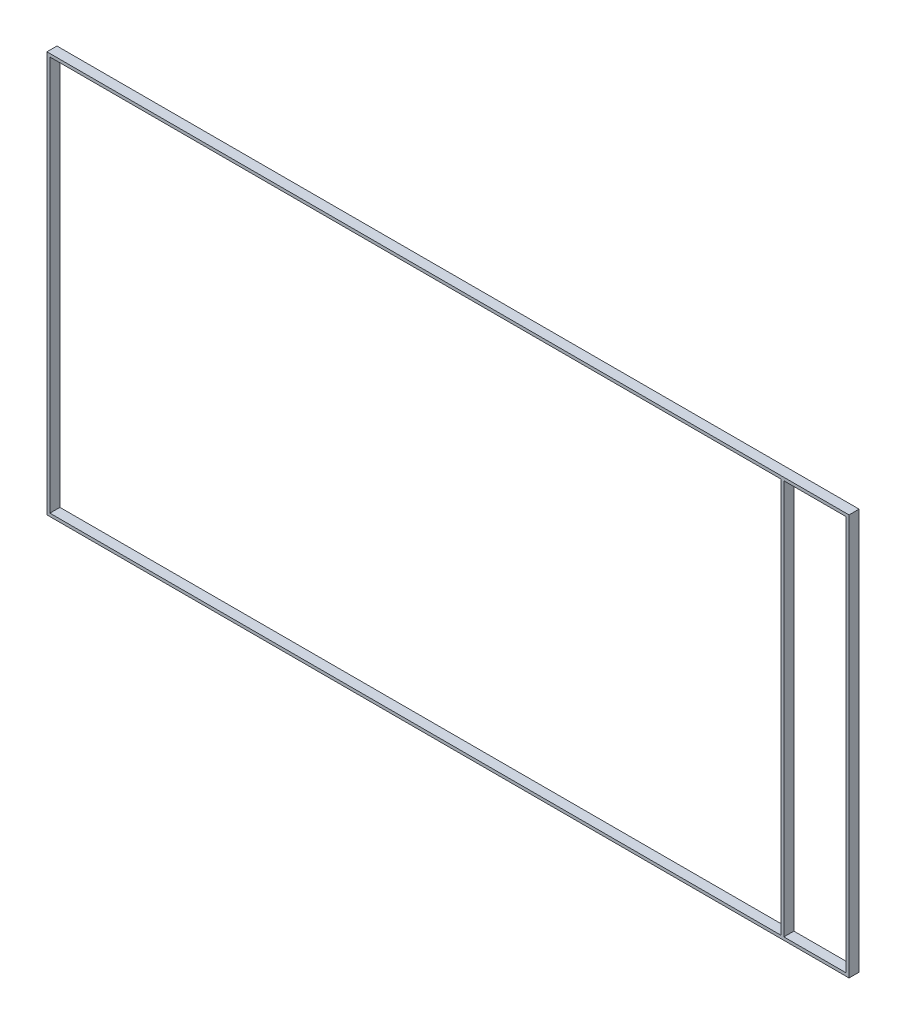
from build123d import *

# Parameters (mm, degrees)
SKETCH_1_W      = 4000
SKETCH_1_H      = 2000
SKETCH_1_W_2    = 3645
SKETCH_1_H_2    = 1970
SKETCH_1_W_3    = 310
EXTRUDE_1_DEPTH = 50


with BuildPart() as part:
    # Sketch 1 → Extrude 1 (new body)
    with BuildSketch(Plane.XY):
        Rectangle(SKETCH_1_W, SKETCH_1_H)
        with Locations((-162.5, 0)):
            Rectangle(SKETCH_1_W_2, SKETCH_1_H_2, mode=Mode.SUBTRACT)
        with Locations((1830, 0)):
            Rectangle(SKETCH_1_W_3, SKETCH_1_H_2, mode=Mode.SUBTRACT)
    extrude(amount=EXTRUDE_1_DEPTH)


solid = part.part
